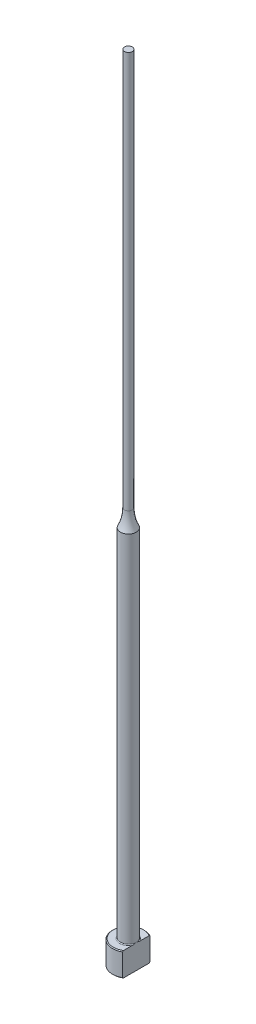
ISO-10303-21;
HEADER;
FILE_DESCRIPTION(('STEP AP214'),'2;1');
FILE_NAME('part.step','',(''),(''),'','','');
FILE_SCHEMA(('AUTOMOTIVE_DESIGN { 1 0 10303 214 1 1 1 1 }'));
ENDSEC;
DATA;
#1=APPLICATION_CONTEXT('core data for automotive mechanical design processes');
#2=APPLICATION_PROTOCOL_DEFINITION('international standard','automotive_design',2000,#1);
#3=PRODUCT_CONTEXT('',#1,'mechanical');
#4=PRODUCT('Part','Part','',(#3));
#5=PRODUCT_RELATED_PRODUCT_CATEGORY('part','',(#4));
#6=PRODUCT_DEFINITION_FORMATION('','',#4);
#7=PRODUCT_DEFINITION_CONTEXT('part definition',#1,'design');
#8=PRODUCT_DEFINITION('design','',#6,#7);
#9=PRODUCT_DEFINITION_SHAPE('','',#8);
#10=(LENGTH_UNIT() NAMED_UNIT(*) SI_UNIT(.MILLI.,.METRE.));
#11=(NAMED_UNIT(*) PLANE_ANGLE_UNIT() SI_UNIT($,.RADIAN.));
#12=(NAMED_UNIT(*) SI_UNIT($,.STERADIAN.) SOLID_ANGLE_UNIT());
#13=UNCERTAINTY_MEASURE_WITH_UNIT(LENGTH_MEASURE(1.E-05),#10,'distance_accuracy_value','');
#14=(GEOMETRIC_REPRESENTATION_CONTEXT(3) GLOBAL_UNCERTAINTY_ASSIGNED_CONTEXT((#13)) GLOBAL_UNIT_ASSIGNED_CONTEXT((#10,
#11,#12)) REPRESENTATION_CONTEXT('',''));
#15=CARTESIAN_POINT('',(0.,0.,0.));
#16=DIRECTION('',(0.,0.,1.));
#17=DIRECTION('',(1.,0.,0.));
#18=AXIS2_PLACEMENT_3D('',#15,#16,#17);
#19=CARTESIAN_POINT('',(-3.99999999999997,6.,0.));
#20=DIRECTION('',(0.,1.,0.));
#21=DIRECTION('',(0.,0.,1.));
#22=AXIS2_PLACEMENT_3D('',#19,#20,#21);
#23=PLANE('',#22);
#24=CARTESIAN_POINT('',(0.,6.,0.));
#25=DIRECTION('',(0.,1.,0.));
#26=DIRECTION('',(0.,0.,1.));
#27=AXIS2_PLACEMENT_3D('',#24,#25,#26);
#28=CIRCLE('',#27,3.80000000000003);
#29=CARTESIAN_POINT('',(1.99999999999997,6.,-3.23109888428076));
#30=VERTEX_POINT('',#29);
#31=CARTESIAN_POINT('',(1.99999999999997,6.,3.23109888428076));
#32=VERTEX_POINT('',#31);
#33=EDGE_CURVE('E187',#30,#32,#28,.T.);
#34=ORIENTED_EDGE('',*,*,#33,.T.);
#35=DIRECTION('',(0.,0.,-1.));
#36=VECTOR('',#35,1.);
#37=CARTESIAN_POINT('',(1.99999999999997,6.,0.));
#38=LINE('',#37,#36);
#39=CARTESIAN_POINT('',(1.99999999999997,5.99999999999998,0.916515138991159));
#40=VERTEX_POINT('',#39);
#41=EDGE_CURVE('E57',#32,#40,#38,.T.);
#42=ORIENTED_EDGE('',*,*,#41,.T.);
#43=CARTESIAN_POINT('',(0.,6.,0.));
#44=DIRECTION('',(0.,1.,0.));
#45=DIRECTION('',(0.,0.,1.));
#46=AXIS2_PLACEMENT_3D('',#43,#44,#45);
#47=CIRCLE('',#46,2.19999999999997);
#48=CARTESIAN_POINT('',(1.99999999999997,5.99999999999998,-0.916515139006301));
#49=VERTEX_POINT('',#48);
#50=EDGE_CURVE('E108',#40,#49,#47,.F.);
#51=ORIENTED_EDGE('',*,*,#50,.T.);
#52=EDGE_CURVE('E137',#49,#30,#38,.T.);
#53=ORIENTED_EDGE('',*,*,#52,.T.);
#54=EDGE_LOOP('',(#34,#42,#51,#53));
#55=FACE_BOUND('',#54,.T.);
#56=ADVANCED_FACE('F32',(#55),#23,.T.);
#57=CARTESIAN_POINT('',(0.,259.958771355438,0.));
#58=DIRECTION('',(0.,1.,0.));
#59=DIRECTION('',(0.,0.,1.));
#60=AXIS2_PLACEMENT_3D('',#57,#58,#59);
#61=CYLINDRICAL_SURFACE('',#60,3.99999999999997);
#62=CARTESIAN_POINT('',(0.,5.80000000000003,0.));
#63=DIRECTION('',(0.,1.,0.));
#64=DIRECTION('',(0.,0.,1.));
#65=AXIS2_PLACEMENT_3D('',#62,#63,#64);
#66=CIRCLE('',#65,3.99999999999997);
#67=CARTESIAN_POINT('',(1.99999999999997,5.80000000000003,3.46410161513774));
#68=VERTEX_POINT('',#67);
#69=CARTESIAN_POINT('',(1.99999999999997,5.80000000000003,-3.46410161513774));
#70=VERTEX_POINT('',#69);
#71=EDGE_CURVE('E105',#68,#70,#66,.F.);
#72=ORIENTED_EDGE('',*,*,#71,.T.);
#73=DIRECTION('',(0.,-1.,0.));
#74=VECTOR('',#73,1.);
#75=CARTESIAN_POINT('',(1.99999999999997,200.,-3.46410161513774));
#76=LINE('',#75,#74);
#77=CARTESIAN_POINT('',(1.99999999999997,0.199999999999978,-3.46410161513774));
#78=VERTEX_POINT('',#77);
#79=EDGE_CURVE('E193',#70,#78,#76,.T.);
#80=ORIENTED_EDGE('',*,*,#79,.T.);
#81=CARTESIAN_POINT('',(0.,0.199999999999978,0.));
#82=DIRECTION('',(0.,-1.,0.));
#83=DIRECTION('',(0.,0.,-1.));
#84=AXIS2_PLACEMENT_3D('',#81,#82,#83);
#85=CIRCLE('',#84,3.99999999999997);
#86=CARTESIAN_POINT('',(1.99999999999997,0.199999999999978,3.46410161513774));
#87=VERTEX_POINT('',#86);
#88=EDGE_CURVE('E100',#78,#87,#85,.F.);
#89=ORIENTED_EDGE('',*,*,#88,.T.);
#90=DIRECTION('',(0.,-1.,0.));
#91=VECTOR('',#90,1.);
#92=CARTESIAN_POINT('',(1.99999999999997,200.,3.46410161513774));
#93=LINE('',#92,#91);
#94=EDGE_CURVE('E93',#68,#87,#93,.T.);
#95=ORIENTED_EDGE('',*,*,#94,.F.);
#96=EDGE_LOOP('',(#72,#80,#89,#95));
#97=FACE_BOUND('',#96,.T.);
#98=ADVANCED_FACE('F158',(#97),#61,.T.);
#99=CARTESIAN_POINT('',(0.,0.,0.));
#100=DIRECTION('',(0.,-1.,0.));
#101=DIRECTION('',(0.,0.,-1.));
#102=AXIS2_PLACEMENT_3D('',#99,#100,#101);
#103=PLANE('',#102);
#104=CARTESIAN_POINT('',(0.,0.,0.));
#105=DIRECTION('',(0.,-1.,0.));
#106=DIRECTION('',(0.,0.,-1.));
#107=AXIS2_PLACEMENT_3D('',#104,#105,#106);
#108=CIRCLE('',#107,3.79999999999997);
#109=CARTESIAN_POINT('',(1.99999999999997,0.,3.23109888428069));
#110=VERTEX_POINT('',#109);
#111=CARTESIAN_POINT('',(1.99999999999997,0.,-3.23109888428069));
#112=VERTEX_POINT('',#111);
#113=EDGE_CURVE('E98',#110,#112,#108,.T.);
#114=ORIENTED_EDGE('',*,*,#113,.T.);
#115=DIRECTION('',(0.,0.,1.));
#116=VECTOR('',#115,1.);
#117=CARTESIAN_POINT('',(1.99999999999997,0.,3.46410161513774));
#118=LINE('',#117,#116);
#119=EDGE_CURVE('E83',#112,#110,#118,.T.);
#120=ORIENTED_EDGE('',*,*,#119,.T.);
#121=EDGE_LOOP('',(#114,#120));
#122=FACE_BOUND('',#121,.T.);
#123=ADVANCED_FACE('F103',(#122),#103,.T.);
#124=CARTESIAN_POINT('',(0.,6.00000000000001,0.));
#125=DIRECTION('',(0.,-1.,0.));
#126=DIRECTION('',(0.,0.,-1.));
#127=AXIS2_PLACEMENT_3D('',#124,#125,#126);
#128=CONICAL_SURFACE('',#127,3.80000000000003,0.785398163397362);
#129=ORIENTED_EDGE('',*,*,#71,.F.);
#130=CARTESIAN_POINT('',(1.99999999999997,1.91904532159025,7.62295524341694));
#131=CARTESIAN_POINT('',(1.99999999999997,2.08611243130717,7.4502239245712));
#132=CARTESIAN_POINT('',(1.99999999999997,2.25300024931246,7.27731861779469));
#133=CARTESIAN_POINT('',(1.99999999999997,2.58631125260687,6.93105655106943));
#134=CARTESIAN_POINT('',(1.99999999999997,2.75273443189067,6.75769978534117));
#135=CARTESIAN_POINT('',(1.99999999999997,3.08509080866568,6.41034692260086));
#136=CARTESIAN_POINT('',(1.99999999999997,3.25102371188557,6.23635054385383));
#137=CARTESIAN_POINT('',(1.99999999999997,3.58215598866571,5.88766284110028));
#138=CARTESIAN_POINT('',(1.99999999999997,3.74735536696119,5.71297152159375));
#139=CARTESIAN_POINT('',(1.99999999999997,4.0735385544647,5.36616839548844));
#140=CARTESIAN_POINT('',(1.99999999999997,4.23454099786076,5.19407412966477));
#141=CARTESIAN_POINT('',(1.99999999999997,4.55534102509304,4.84876663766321));
#142=CARTESIAN_POINT('',(1.99999999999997,4.71513861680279,4.67555341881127));
#143=CARTESIAN_POINT('',(1.99999999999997,5.0330618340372,4.32766569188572));
#144=CARTESIAN_POINT('',(1.99999999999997,5.191187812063,4.15299150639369));
#145=CARTESIAN_POINT('',(1.99999999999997,5.50513944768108,3.80159134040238));
#146=CARTESIAN_POINT('',(1.99999999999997,5.66096519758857,3.62486544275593));
#147=CARTESIAN_POINT('',(1.99999999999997,5.90974646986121,3.33722425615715));
#148=CARTESIAN_POINT('',(1.99999999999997,6.00376148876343,3.22722645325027));
#149=CARTESIAN_POINT('',(1.99999999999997,6.19011825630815,3.00579987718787));
#150=CARTESIAN_POINT('',(1.99999999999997,6.28245983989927,2.89437096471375));
#151=CARTESIAN_POINT('',(1.99999999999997,6.46586188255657,2.66849662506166));
#152=CARTESIAN_POINT('',(1.99999999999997,6.55689849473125,2.55403176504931));
#153=CARTESIAN_POINT('',(1.99999999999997,6.73578809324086,2.32266819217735));
#154=CARTESIAN_POINT('',(1.99999999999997,6.82364184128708,2.20577007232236));
#155=CARTESIAN_POINT('',(1.99999999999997,6.99612756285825,1.96688707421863));
#156=CARTESIAN_POINT('',(1.99999999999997,7.08069035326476,1.84485190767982));
#157=CARTESIAN_POINT('',(1.99999999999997,7.2430026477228,1.59599329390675));
#158=CARTESIAN_POINT('',(1.99999999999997,7.32074277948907,1.46916359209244));
#159=CARTESIAN_POINT('',(1.99999999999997,7.42869763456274,1.27510066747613));
#160=CARTESIAN_POINT('',(1.99999999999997,7.46305374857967,1.21018943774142));
#161=CARTESIAN_POINT('',(1.99999999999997,7.52837146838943,1.07868835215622));
#162=CARTESIAN_POINT('',(1.99999999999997,7.55933245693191,1.01209819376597));
#163=CARTESIAN_POINT('',(1.99999999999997,7.64566860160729,0.8098943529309));
#164=CARTESIAN_POINT('',(1.99999999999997,7.69478214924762,0.671360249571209));
#165=CARTESIAN_POINT('',(1.99999999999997,7.74794829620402,0.463657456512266));
#166=CARTESIAN_POINT('',(1.99999999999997,7.76205065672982,0.397033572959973));
#167=CARTESIAN_POINT('',(1.99999999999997,7.78390371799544,0.26272845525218));
#168=CARTESIAN_POINT('',(1.99999999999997,7.79165498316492,0.19504731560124));
#169=CARTESIAN_POINT('',(1.99999999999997,7.80025690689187,0.0594528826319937));
#170=CARTESIAN_POINT('',(1.99999999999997,7.80112894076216,-0.00845903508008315));
#171=CARTESIAN_POINT('',(1.99999999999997,7.79596585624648,-0.144020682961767));
#172=CARTESIAN_POINT('',(1.99999999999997,7.78993016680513,-0.211670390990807));
#173=CARTESIAN_POINT('',(1.99999999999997,7.77145363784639,-0.345483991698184));
#174=CARTESIAN_POINT('',(1.99999999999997,7.7590677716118,-0.411655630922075));
#175=CARTESIAN_POINT('',(1.99999999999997,7.72866360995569,-0.542678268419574));
#176=CARTESIAN_POINT('',(1.99999999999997,7.71064463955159,-0.607529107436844));
#177=CARTESIAN_POINT('',(1.99999999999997,7.669729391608,-0.736064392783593));
#178=CARTESIAN_POINT('',(1.99999999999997,7.64680564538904,-0.79973998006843));
#179=CARTESIAN_POINT('',(1.99999999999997,7.59700147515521,-0.925489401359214));
#180=CARTESIAN_POINT('',(1.99999999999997,7.57012185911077,-0.98756355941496));
#181=CARTESIAN_POINT('',(1.99999999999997,7.48443518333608,-1.17209020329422));
#182=CARTESIAN_POINT('',(1.99999999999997,7.42077407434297,-1.29228210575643));
#183=CARTESIAN_POINT('',(1.99999999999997,7.28502644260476,-1.52785770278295));
#184=CARTESIAN_POINT('',(1.99999999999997,7.21292931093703,-1.6432350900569));
#185=CARTESIAN_POINT('',(1.99999999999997,7.06281517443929,-1.8706938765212));
#186=CARTESIAN_POINT('',(1.99999999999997,6.98477595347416,-1.98276048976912));
#187=CARTESIAN_POINT('',(1.99999999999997,6.8248197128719,-2.20397837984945));
#188=CARTESIAN_POINT('',(1.99999999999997,6.74290465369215,-2.31313108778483));
#189=CARTESIAN_POINT('',(1.99999999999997,6.57517222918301,-2.5306854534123));
#190=CARTESIAN_POINT('',(1.99999999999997,6.4893176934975,-2.63905831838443));
#191=CARTESIAN_POINT('',(1.99999999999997,6.31548151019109,-2.85409686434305));
#192=CARTESIAN_POINT('',(1.99999999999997,6.22749963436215,-2.96076236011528));
#193=CARTESIAN_POINT('',(1.99999999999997,6.05015030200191,-3.17249211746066));
#194=CARTESIAN_POINT('',(1.99999999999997,5.96078672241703,-3.27755963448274));
#195=CARTESIAN_POINT('',(1.99999999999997,5.78082366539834,-3.48663191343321));
#196=CARTESIAN_POINT('',(1.99999999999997,5.69022416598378,-3.59063665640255));
#197=CARTESIAN_POINT('',(1.99999999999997,5.44796733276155,-3.86612439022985));
#198=CARTESIAN_POINT('',(1.99999999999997,5.29545972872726,-4.03685912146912));
#199=CARTESIAN_POINT('',(1.99999999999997,4.98858070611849,-4.37664803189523));
#200=CARTESIAN_POINT('',(1.99999999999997,4.83420923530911,-4.54570216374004));
#201=CARTESIAN_POINT('',(1.99999999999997,4.52396102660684,-4.88271638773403));
#202=CARTESIAN_POINT('',(1.99999999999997,4.36808300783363,-5.05067529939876));
#203=CARTESIAN_POINT('',(1.99999999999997,4.05530513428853,-5.38563883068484));
#204=CARTESIAN_POINT('',(1.99999999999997,3.8984052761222,-5.55264344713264));
#205=CARTESIAN_POINT('',(1.99999999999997,3.59029018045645,-5.87905385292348));
#206=CARTESIAN_POINT('',(1.99999999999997,3.43910664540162,-6.03848959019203));
#207=CARTESIAN_POINT('',(1.99999999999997,3.13616436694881,-6.35681456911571));
#208=CARTESIAN_POINT('',(1.99999999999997,2.98440562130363,-6.5157038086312));
#209=CARTESIAN_POINT('',(1.99999999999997,2.68059501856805,-6.83286192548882));
#210=CARTESIAN_POINT('',(1.99999999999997,2.52854367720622,-6.99113129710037));
#211=CARTESIAN_POINT('',(1.99999999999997,2.22406035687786,-7.30730102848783));
#212=CARTESIAN_POINT('',(1.99999999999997,2.07162838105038,-7.46520139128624));
#213=CARTESIAN_POINT('',(1.99999999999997,1.91904532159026,-7.62295524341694));
#214=B_SPLINE_CURVE_WITH_KNOTS('',3,(#130,#131,#132,#133,#134,#135,#136,#137,#138,#139,#140,
#141,#142,#143,#144,#145,#146,#147,#148,#149,#150,#151,#152,#153,#154,#155,#156,#157,#158,#159,
#160,#161,#162,#163,#164,#165,#166,#167,#168,#169,#170,#171,#172,#173,#174,#175,#176,#177,#178,
#179,#180,#181,#182,#183,#184,#185,#186,#187,#188,#189,#190,#191,#192,#193,#194,#195,#196,#197,
#198,#199,#200,#201,#202,#203,#204,#205,#206,#207,#208,#209,#210,#211,#212,#213),.UNSPECIFIED.,
.F.,.F.,(4,2,2,2,2,2,2,2,2,2,2,2,2,2,2,2,2,2,2,2,2,2,2,2,2,2,2,2,2,2,2,2,2,2,2,2,2,2,2,2,2,4),
(0.,0.720921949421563,1.4418531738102,2.16315326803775,2.8844486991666,3.59144103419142,
4.29842874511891,5.00526427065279,5.7120713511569,6.14616174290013,6.58029471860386,
7.01901494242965,7.45762947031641,7.90290456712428,8.34878206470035,8.56901415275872,
8.78928621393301,9.228144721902,9.43219512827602,9.63622739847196,9.83962544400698,
10.0430403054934,10.244723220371,10.4464303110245,10.6492980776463,10.8521244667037,
11.2595582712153,11.6675100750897,12.0770700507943,12.4864250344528,12.9011677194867,
13.3159550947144,13.7297367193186,14.1435257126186,14.8302935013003,15.5170805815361,
16.2045145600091,16.891950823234,17.5511045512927,18.2102608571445,18.8686819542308,
19.5270976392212),.UNSPECIFIED.);
#215=EDGE_CURVE('E136',#68,#32,#214,.T.);
#216=ORIENTED_EDGE('',*,*,#215,.T.);
#217=ORIENTED_EDGE('',*,*,#33,.F.);
#218=EDGE_CURVE('E128',#30,#70,#214,.T.);
#219=ORIENTED_EDGE('',*,*,#218,.T.);
#220=EDGE_LOOP('',(#129,#216,#217,#219));
#221=FACE_BOUND('',#220,.T.);
#222=ADVANCED_FACE('F144',(#221),#128,.T.);
#223=CARTESIAN_POINT('',(0.,0.199999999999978,0.));
#224=DIRECTION('',(0.,1.,0.));
#225=DIRECTION('',(0.,0.,1.));
#226=AXIS2_PLACEMENT_3D('',#223,#224,#225);
#227=CONICAL_SURFACE('',#226,3.99999999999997,0.7853981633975);
#228=ORIENTED_EDGE('',*,*,#88,.F.);
#229=CARTESIAN_POINT('',(1.99999999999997,4.08095467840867,-7.62295524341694));
#230=CARTESIAN_POINT('',(1.99999999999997,3.91388756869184,-7.45022392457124));
#231=CARTESIAN_POINT('',(1.99999999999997,3.74699975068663,-7.27731861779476));
#232=CARTESIAN_POINT('',(1.99999999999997,3.41368874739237,-6.93105655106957));
#233=CARTESIAN_POINT('',(1.99999999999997,3.24726556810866,-6.75769978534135));
#234=CARTESIAN_POINT('',(1.99999999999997,2.91490919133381,-6.4103469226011));
#235=CARTESIAN_POINT('',(1.99999999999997,2.74897628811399,-6.23635054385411));
#236=CARTESIAN_POINT('',(1.99999999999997,2.41784401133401,-5.88766284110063));
#237=CARTESIAN_POINT('',(1.99999999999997,2.25264463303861,-5.71297152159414));
#238=CARTESIAN_POINT('',(1.99999999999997,1.92646144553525,-5.3661683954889));
#239=CARTESIAN_POINT('',(1.99999999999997,1.76545900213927,-5.19407412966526));
#240=CARTESIAN_POINT('',(1.99999999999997,1.44465897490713,-4.84876663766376));
#241=CARTESIAN_POINT('',(1.99999999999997,1.28486138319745,-4.67555341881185));
#242=CARTESIAN_POINT('',(1.99999999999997,0.966938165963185,-4.32766569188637));
#243=CARTESIAN_POINT('',(1.99999999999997,0.80881218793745,-4.15299150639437));
#244=CARTESIAN_POINT('',(1.99999999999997,0.494860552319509,-3.80159134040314));
#245=CARTESIAN_POINT('',(1.99999999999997,0.339034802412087,-3.62486544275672));
#246=CARTESIAN_POINT('',(1.99999999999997,0.0902535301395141,-3.33722425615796));
#247=CARTESIAN_POINT('',(1.99999999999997,-0.0037614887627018,-3.22722645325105));
#248=CARTESIAN_POINT('',(1.99999999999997,-0.190118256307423,-3.0057998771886));
#249=CARTESIAN_POINT('',(1.99999999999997,-0.282459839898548,-2.89437096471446));
#250=CARTESIAN_POINT('',(1.99999999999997,-0.465861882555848,-2.66849662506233));
#251=CARTESIAN_POINT('',(1.99999999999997,-0.556898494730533,-2.55403176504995));
#252=CARTESIAN_POINT('',(1.99999999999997,-0.735788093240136,-2.32266819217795));
#253=CARTESIAN_POINT('',(1.99999999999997,-0.823641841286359,-2.20577007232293));
#254=CARTESIAN_POINT('',(1.99999999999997,-0.996127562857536,-1.96688707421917));
#255=CARTESIAN_POINT('',(1.99999999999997,-1.08069035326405,-1.84485190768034));
#256=CARTESIAN_POINT('',(1.99999999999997,-1.2430026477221,-1.59599329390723));
#257=CARTESIAN_POINT('',(1.99999999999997,-1.32074277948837,-1.4691635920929));
#258=CARTESIAN_POINT('',(1.99999999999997,-1.42869763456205,-1.27510066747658));
#259=CARTESIAN_POINT('',(1.99999999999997,-1.46305374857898,-1.21018943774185));
#260=CARTESIAN_POINT('',(1.99999999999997,-1.52837146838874,-1.07868835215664));
#261=CARTESIAN_POINT('',(1.99999999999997,-1.55933245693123,-1.01209819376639));
#262=CARTESIAN_POINT('',(1.99999999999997,-1.64566860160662,-0.809894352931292));
#263=CARTESIAN_POINT('',(1.99999999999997,-1.69478214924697,-0.671360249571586));
#264=CARTESIAN_POINT('',(1.99999999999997,-1.74794829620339,-0.463657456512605));
#265=CARTESIAN_POINT('',(1.99999999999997,-1.76205065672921,-0.397033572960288));
#266=CARTESIAN_POINT('',(1.99999999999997,-1.78390371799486,-0.262728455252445));
#267=CARTESIAN_POINT('',(1.99999999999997,-1.79165498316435,-0.19504731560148));
#268=CARTESIAN_POINT('',(1.99999999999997,-1.80025690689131,-0.059452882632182));
#269=CARTESIAN_POINT('',(1.99999999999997,-1.8011289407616,0.00845903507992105));
#270=CARTESIAN_POINT('',(1.99999999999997,-1.79596585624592,0.144020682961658));
#271=CARTESIAN_POINT('',(1.99999999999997,-1.78993016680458,0.211670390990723));
#272=CARTESIAN_POINT('',(1.99999999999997,-1.77145363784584,0.345483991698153));
#273=CARTESIAN_POINT('',(1.99999999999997,-1.75906777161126,0.411655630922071));
#274=CARTESIAN_POINT('',(1.99999999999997,-1.72866360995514,0.542678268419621));
#275=CARTESIAN_POINT('',(1.99999999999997,-1.71064463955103,0.607529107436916));
#276=CARTESIAN_POINT('',(1.99999999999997,-1.66972939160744,0.736064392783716));
#277=CARTESIAN_POINT('',(1.99999999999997,-1.64680564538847,0.799739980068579));
#278=CARTESIAN_POINT('',(1.99999999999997,-1.59700147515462,0.925489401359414));
#279=CARTESIAN_POINT('',(1.99999999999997,-1.57012185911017,0.987563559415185));
#280=CARTESIAN_POINT('',(1.99999999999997,-1.48443518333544,1.17209020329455));
#281=CARTESIAN_POINT('',(1.99999999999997,-1.4207740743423,1.29228210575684));
#282=CARTESIAN_POINT('',(1.99999999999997,-1.28502644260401,1.52785770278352));
#283=CARTESIAN_POINT('',(1.99999999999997,-1.21292931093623,1.64323509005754));
#284=CARTESIAN_POINT('',(1.99999999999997,-1.0628151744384,1.87069387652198));
#285=CARTESIAN_POINT('',(1.99999999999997,-0.984775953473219,1.98276048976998));
#286=CARTESIAN_POINT('',(1.99999999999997,-0.82481971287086,2.20397837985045));
#287=CARTESIAN_POINT('',(1.99999999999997,-0.742904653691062,2.31313108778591));
#288=CARTESIAN_POINT('',(1.99999999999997,-0.575172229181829,2.53068545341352));
#289=CARTESIAN_POINT('',(1.99999999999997,-0.489317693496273,2.63905831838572));
#290=CARTESIAN_POINT('',(1.99999999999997,-0.315481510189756,2.85409686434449));
#291=CARTESIAN_POINT('',(1.99999999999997,-0.227499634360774,2.9607623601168));
#292=CARTESIAN_POINT('',(1.99999999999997,-0.0501503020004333,3.17249211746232));
#293=CARTESIAN_POINT('',(1.99999999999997,0.0392132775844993,3.27755963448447));
#294=CARTESIAN_POINT('',(1.99999999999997,0.219176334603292,3.48663191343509));
#295=CARTESIAN_POINT('',(1.99999999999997,0.309775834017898,3.59063665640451));
#296=CARTESIAN_POINT('',(1.99999999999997,0.552032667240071,3.86612439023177));
#297=CARTESIAN_POINT('',(1.99999999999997,0.704540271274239,4.03685912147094));
#298=CARTESIAN_POINT('',(1.99999999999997,1.01141929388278,4.37664803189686));
#299=CARTESIAN_POINT('',(1.99999999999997,1.16579076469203,4.54570216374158));
#300=CARTESIAN_POINT('',(1.99999999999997,1.47603897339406,4.88271638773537));
#301=CARTESIAN_POINT('',(1.99999999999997,1.63191699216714,5.05067529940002));
#302=CARTESIAN_POINT('',(1.99999999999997,1.94469486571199,5.38563883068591));
#303=CARTESIAN_POINT('',(1.99999999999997,2.10159472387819,5.55264344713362));
#304=CARTESIAN_POINT('',(1.99999999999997,2.40970981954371,5.87905385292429));
#305=CARTESIAN_POINT('',(1.99999999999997,2.56089335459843,6.03848959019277));
#306=CARTESIAN_POINT('',(1.99999999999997,2.86383563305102,6.3568145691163));
#307=CARTESIAN_POINT('',(1.99999999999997,3.01559437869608,6.51570380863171));
#308=CARTESIAN_POINT('',(1.99999999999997,3.31940498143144,6.83286192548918));
#309=CARTESIAN_POINT('',(1.99999999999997,3.47145632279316,6.99113129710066));
#310=CARTESIAN_POINT('',(1.99999999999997,3.77593964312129,7.30730102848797));
#311=CARTESIAN_POINT('',(1.99999999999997,3.92837161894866,7.46520139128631));
#312=CARTESIAN_POINT('',(1.99999999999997,4.08095467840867,7.62295524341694));
#313=B_SPLINE_CURVE_WITH_KNOTS('',3,(#229,#230,#231,#232,#233,#234,#235,#236,#237,#238,#239,
#240,#241,#242,#243,#244,#245,#246,#247,#248,#249,#250,#251,#252,#253,#254,#255,#256,#257,#258,
#259,#260,#261,#262,#263,#264,#265,#266,#267,#268,#269,#270,#271,#272,#273,#274,#275,#276,#277,
#278,#279,#280,#281,#282,#283,#284,#285,#286,#287,#288,#289,#290,#291,#292,#293,#294,#295,#296,
#297,#298,#299,#300,#301,#302,#303,#304,#305,#306,#307,#308,#309,#310,#311,#312),.UNSPECIFIED.,
.F.,.F.,(4,2,2,2,2,2,2,2,2,2,2,2,2,2,2,2,2,2,2,2,2,2,2,2,2,2,2,2,2,2,2,2,2,2,2,2,2,2,2,2,2,4),
(0.,0.720921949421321,1.44185317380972,2.16315326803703,2.88444869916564,3.59144103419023,
4.29842874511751,5.00526427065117,5.71207135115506,6.14616174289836,6.58029471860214,
7.01901494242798,7.45762947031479,7.90290456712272,8.34878206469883,8.56901415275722,
8.78928621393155,9.22814472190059,9.43219512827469,9.63622739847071,9.8396254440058,
10.0430403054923,10.24472322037,10.4464303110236,10.6492980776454,10.8521244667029,
11.2595582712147,11.6675100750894,12.0770700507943,12.4864250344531,12.9011677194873,
13.3159550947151,13.7297367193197,14.1435257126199,14.8302935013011,15.5170805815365,
16.204514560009,16.8919508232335,17.5511045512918,18.2102608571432,18.8686819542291,
19.5270976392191),.UNSPECIFIED.);
#314=EDGE_CURVE('E86',#78,#112,#313,.T.);
#315=ORIENTED_EDGE('',*,*,#314,.T.);
#316=ORIENTED_EDGE('',*,*,#113,.F.);
#317=EDGE_CURVE('E89',#110,#87,#313,.T.);
#318=ORIENTED_EDGE('',*,*,#317,.T.);
#319=EDGE_LOOP('',(#228,#315,#316,#318));
#320=FACE_BOUND('',#319,.T.);
#321=ADVANCED_FACE('F97',(#320),#227,.T.);
#322=CARTESIAN_POINT('',(0.,6.19999999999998,0.));
#323=DIRECTION('',(0.,1.,0.));
#324=DIRECTION('',(0.,0.,1.));
#325=AXIS2_PLACEMENT_3D('',#322,#323,#324);
#326=TOROIDAL_SURFACE('',#325,2.19999999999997,0.2);
#327=CARTESIAN_POINT('',(1.99999999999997,6.19999999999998,0.));
#328=CARTESIAN_POINT('',(1.99999999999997,6.20000050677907,1.13930141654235E-10));
#329=CARTESIAN_POINT('',(1.99999999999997,6.20000101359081,-1.46766795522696E-07));
#330=CARTESIAN_POINT('',(1.99999999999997,6.20000197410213,-5.82067451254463E-07));
#331=CARTESIAN_POINT('',(1.99999999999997,6.20000242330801,-8.77873018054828E-07));
#332=CARTESIAN_POINT('',(1.99999999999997,6.2000033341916,-1.5842451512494E-06));
#333=CARTESIAN_POINT('',(1.99999999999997,6.20000378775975,-2.00534283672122E-06));
#334=CARTESIAN_POINT('',(1.99999999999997,6.20000462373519,-2.89558841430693E-06));
#335=CARTESIAN_POINT('',(1.99999999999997,6.20000500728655,-3.36372325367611E-06));
#336=CARTESIAN_POINT('',(1.99999999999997,6.20000636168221,-5.10887550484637E-06));
#337=CARTESIAN_POINT('',(1.99999999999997,6.20000725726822,-6.44597279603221E-06));
#338=CARTESIAN_POINT('',(1.99999999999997,6.20000879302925,-9.14926716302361E-06));
#339=CARTESIAN_POINT('',(1.99999999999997,6.20000944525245,-1.0508971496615E-05));
#340=CARTESIAN_POINT('',(1.99999999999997,6.20001204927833,-1.60555880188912E-05));
#341=CARTESIAN_POINT('',(1.99999999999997,6.20001390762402,-2.02908747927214E-05));
#342=CARTESIAN_POINT('',(1.99999999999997,6.20001676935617,-2.84438494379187E-05));
#343=CARTESIAN_POINT('',(1.99999999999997,6.20001785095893,-3.23343259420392E-05));
#344=CARTESIAN_POINT('',(1.99999999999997,6.20002551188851,-6.06027145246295E-05));
#345=CARTESIAN_POINT('',(1.99999999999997,6.20003111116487,-8.51991847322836E-05));
#346=CARTESIAN_POINT('',(1.99999999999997,6.20005559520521,-0.00018156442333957));
#347=CARTESIAN_POINT('',(1.99999999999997,6.20007914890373,-0.000252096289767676));
#348=CARTESIAN_POINT('',(1.99999999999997,6.20017002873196,-0.00052958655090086));
#349=CARTESIAN_POINT('',(1.99999999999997,6.20023415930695,-0.00073729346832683));
#350=CARTESIAN_POINT('',(1.99999999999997,6.20048926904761,-0.00155657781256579));
#351=CARTESIAN_POINT('',(1.99999999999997,6.20068414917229,-0.00216722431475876));
#352=CARTESIAN_POINT('',(1.99999999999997,6.20148805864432,-0.0046938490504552));
#353=CARTESIAN_POINT('',(1.99999999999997,6.20209226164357,-0.00661098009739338));
#354=CARTESIAN_POINT('',(1.99999999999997,6.20822779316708,-0.026069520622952));
#355=CARTESIAN_POINT('',(1.99999999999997,6.21378174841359,-0.0436057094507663));
#356=CARTESIAN_POINT('',(1.99999999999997,6.22462834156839,-0.0780127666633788));
#357=CARTESIAN_POINT('',(1.99999999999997,6.22992277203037,-0.0948831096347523));
#358=CARTESIAN_POINT('',(1.99999999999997,6.24110477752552,-0.130713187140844));
#359=CARTESIAN_POINT('',(1.99999999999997,6.24698536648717,-0.149675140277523));
#360=CARTESIAN_POINT('',(1.99999999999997,6.25869835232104,-0.187834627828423));
#361=CARTESIAN_POINT('',(1.99999999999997,6.26452957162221,-0.207032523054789));
#362=CARTESIAN_POINT('',(1.99999999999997,6.27861584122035,-0.254071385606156));
#363=CARTESIAN_POINT('',(1.99999999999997,6.28678835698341,-0.281937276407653));
#364=CARTESIAN_POINT('',(1.99999999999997,6.30249503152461,-0.33711523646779));
#365=CARTESIAN_POINT('',(1.99999999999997,6.31003989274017,-0.364424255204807));
#366=CARTESIAN_POINT('',(1.99999999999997,6.32554795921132,-0.422841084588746));
#367=CARTESIAN_POINT('',(1.99999999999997,6.33343288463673,-0.453970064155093));
#368=CARTESIAN_POINT('',(1.99999999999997,6.34833120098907,-0.516667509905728));
#369=CARTESIAN_POINT('',(1.99999999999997,6.3553379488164,-0.548237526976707));
#370=CARTESIAN_POINT('',(1.99999999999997,6.37554978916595,-0.647984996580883));
#371=CARTESIAN_POINT('',(1.99999999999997,6.38665117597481,-0.716635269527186));
#372=CARTESIAN_POINT('',(1.99999999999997,6.39785773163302,-0.8324457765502));
#373=CARTESIAN_POINT('',(1.99999999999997,6.40036304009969,-0.879345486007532));
#374=CARTESIAN_POINT('',(1.99999999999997,6.39976024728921,-0.949238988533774));
#375=CARTESIAN_POINT('',(1.99999999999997,6.39886048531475,-0.97224857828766));
#376=CARTESIAN_POINT('',(1.99999999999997,6.39534463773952,-1.01812773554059));
#377=CARTESIAN_POINT('',(1.99999999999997,6.39273014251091,-1.04099741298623));
#378=CARTESIAN_POINT('',(1.99999999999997,6.38623968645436,-1.08102660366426));
#379=CARTESIAN_POINT('',(1.99999999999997,6.38280841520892,-1.09825717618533));
#380=CARTESIAN_POINT('',(1.99999999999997,6.37442567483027,-1.13243508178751));
#381=CARTESIAN_POINT('',(1.99999999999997,6.36946777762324,-1.14938089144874));
#382=CARTESIAN_POINT('',(1.99999999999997,6.35764172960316,-1.18276398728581));
#383=CARTESIAN_POINT('',(1.99999999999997,6.35075810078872,-1.1991959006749));
#384=CARTESIAN_POINT('',(1.99999999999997,6.33462082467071,-1.23083581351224));
#385=CARTESIAN_POINT('',(1.99999999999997,6.32537783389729,-1.24604892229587));
#386=CARTESIAN_POINT('',(1.99999999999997,6.30929159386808,-1.26715296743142));
#387=CARTESIAN_POINT('',(1.99999999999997,6.303567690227,-1.27389441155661));
#388=CARTESIAN_POINT('',(1.99999999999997,6.29128925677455,-1.28659894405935));
#389=CARTESIAN_POINT('',(1.99999999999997,6.28473413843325,-1.29256147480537));
#390=CARTESIAN_POINT('',(1.99999999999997,6.27066594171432,-1.30346436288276));
#391=CARTESIAN_POINT('',(1.99999999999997,6.26314132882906,-1.30839014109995));
#392=CARTESIAN_POINT('',(1.99999999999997,6.24727957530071,-1.31668687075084));
#393=CARTESIAN_POINT('',(1.99999999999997,6.23894498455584,-1.32006252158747));
#394=CARTESIAN_POINT('',(1.99999999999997,6.22424089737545,-1.3241557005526));
#395=CARTESIAN_POINT('',(1.99999999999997,6.21800630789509,-1.32536112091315));
#396=CARTESIAN_POINT('',(1.99999999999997,6.20542266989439,-1.32669615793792));
#397=CARTESIAN_POINT('',(1.99999999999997,6.19907368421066,-1.32682634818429));
#398=CARTESIAN_POINT('',(1.99999999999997,6.18645152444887,-1.32599950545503));
#399=CARTESIAN_POINT('',(1.99999999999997,6.18017831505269,-1.32504300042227));
#400=CARTESIAN_POINT('',(1.99999999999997,6.16787181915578,-1.32212308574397));
#401=CARTESIAN_POINT('',(1.99999999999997,6.16183869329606,-1.32015901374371));
#402=CARTESIAN_POINT('',(1.99999999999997,6.14844260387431,-1.31466566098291));
#403=CARTESIAN_POINT('',(1.99999999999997,6.14119825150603,-1.3108482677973));
#404=CARTESIAN_POINT('',(1.99999999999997,6.12742328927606,-1.30209252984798));
#405=CARTESIAN_POINT('',(1.99999999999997,6.12089414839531,-1.29715193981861));
#406=CARTESIAN_POINT('',(1.99999999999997,6.10554761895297,-1.28382084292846));
#407=CARTESIAN_POINT('',(1.99999999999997,6.09717242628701,-1.27492468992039));
#408=CARTESIAN_POINT('',(1.99999999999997,6.08188323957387,-1.25597903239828));
#409=CARTESIAN_POINT('',(1.99999999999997,6.07497120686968,-1.24592800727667));
#410=CARTESIAN_POINT('',(1.99999999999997,6.05771073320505,-1.21734573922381));
#411=CARTESIAN_POINT('',(1.99999999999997,6.04862251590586,-1.19806017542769));
#412=CARTESIAN_POINT('',(1.99999999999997,6.03323781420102,-1.15830155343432));
#413=CARTESIAN_POINT('',(1.99999999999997,6.02696471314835,-1.13782009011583));
#414=CARTESIAN_POINT('',(1.99999999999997,6.01659159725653,-1.09607450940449));
#415=CARTESIAN_POINT('',(1.99999999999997,6.01251776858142,-1.07480405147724));
#416=CARTESIAN_POINT('',(1.99999999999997,6.0061890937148,-1.03196822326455));
#417=CARTESIAN_POINT('',(1.99999999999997,6.00393768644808,-1.0104023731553));
#418=CARTESIAN_POINT('',(1.99999999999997,5.99950887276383,-0.946948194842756));
#419=CARTESIAN_POINT('',(1.99999999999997,5.99937097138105,-0.904921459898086));
#420=CARTESIAN_POINT('',(1.99999999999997,6.00391139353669,-0.800067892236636));
#421=CARTESIAN_POINT('',(1.99999999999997,6.01103947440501,-0.737378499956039));
#422=CARTESIAN_POINT('',(1.99999999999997,6.0310998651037,-0.61144432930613));
#423=CARTESIAN_POINT('',(1.99999999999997,6.04417074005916,-0.54822386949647));
#424=CARTESIAN_POINT('',(1.99999999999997,6.06920011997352,-0.442888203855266));
#425=CARTESIAN_POINT('',(1.99999999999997,6.08016343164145,-0.400527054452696));
#426=CARTESIAN_POINT('',(1.99999999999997,6.10315303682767,-0.316588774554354));
#427=CARTESIAN_POINT('',(1.99999999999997,6.11516655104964,-0.275008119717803));
#428=CARTESIAN_POINT('',(1.99999999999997,6.13853403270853,-0.196672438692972));
#429=CARTESIAN_POINT('',(1.99999999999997,6.14981294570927,-0.159894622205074));
#430=CARTESIAN_POINT('',(1.99999999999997,6.17316886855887,-0.0849211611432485));
#431=CARTESIAN_POINT('',(1.99999999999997,6.18525959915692,-0.046729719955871));
#432=CARTESIAN_POINT('',(1.99999999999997,6.1979086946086,-0.00660765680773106));
#433=CARTESIAN_POINT('',(1.99999999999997,6.19851400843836,-0.00468723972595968));
#434=CARTESIAN_POINT('',(1.99999999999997,6.199318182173,-0.00215985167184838));
#435=CARTESIAN_POINT('',(1.99999999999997,6.19951225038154,-0.0015517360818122));
#436=CARTESIAN_POINT('',(1.99999999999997,6.19976637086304,-0.000735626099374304));
#437=CARTESIAN_POINT('',(1.99999999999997,6.19983030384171,-0.000528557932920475));
#438=CARTESIAN_POINT('',(1.99999999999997,6.19992094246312,-0.00025181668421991));
#439=CARTESIAN_POINT('',(1.99999999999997,6.1999444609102,-0.000181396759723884));
#440=CARTESIAN_POINT('',(1.99999999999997,6.19996891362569,-8.51622338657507E-05));
#441=CARTESIAN_POINT('',(1.99999999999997,6.19997450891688,-6.05824645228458E-05));
#442=CARTESIAN_POINT('',(1.99999999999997,6.19998216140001,-3.23308902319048E-05));
#443=CARTESIAN_POINT('',(1.99999999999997,6.19998324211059,-2.8441435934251E-05));
#444=CARTESIAN_POINT('',(1.99999999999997,6.19998610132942,-2.02904710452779E-05));
#445=CARTESIAN_POINT('',(1.99999999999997,6.19998795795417,-1.6056119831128E-05));
#446=CARTESIAN_POINT('',(1.99999999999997,6.19999055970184,-1.05104411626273E-05));
#447=CARTESIAN_POINT('',(1.99999999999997,6.19999121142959,-9.15081317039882E-06));
#448=CARTESIAN_POINT('',(1.99999999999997,6.19999274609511,-6.44758195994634E-06));
#449=CARTESIAN_POINT('',(1.99999999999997,6.19999364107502,-5.11046373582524E-06));
#450=CARTESIAN_POINT('',(1.99999999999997,6.1999949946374,-3.36517635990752E-06));
#451=CARTESIAN_POINT('',(1.99999999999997,6.19999537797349,-2.8969795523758E-06));
#452=CARTESIAN_POINT('',(1.99999999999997,6.19999621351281,-2.00657125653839E-06));
#453=CARTESIAN_POINT('',(1.99999999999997,6.19999666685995,-1.58537196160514E-06));
#454=CARTESIAN_POINT('',(1.99999999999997,6.19999757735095,-8.78757217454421E-07));
#455=CARTESIAN_POINT('',(1.99999999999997,6.19999802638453,-5.82817893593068E-07));
#456=CARTESIAN_POINT('',(1.99999999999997,6.19999898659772,-1.47186735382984E-07));
#457=CARTESIAN_POINT('',(1.99999999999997,6.19999949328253,-1.13916285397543E-10));
#458=CARTESIAN_POINT('',(1.99999999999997,6.19999999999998,0.));
#459=B_SPLINE_CURVE_WITH_KNOTS('',3,(#327,#328,#329,#330,#331,#332,#333,#334,#335,#336,#337,
#338,#339,#340,#341,#342,#343,#344,#345,#346,#347,#348,#349,#350,#351,#352,#353,#354,#355,#356,
#357,#358,#359,#360,#361,#362,#363,#364,#365,#366,#367,#368,#369,#370,#371,#372,#373,#374,#375,
#376,#377,#378,#379,#380,#381,#382,#383,#384,#385,#386,#387,#388,#389,#390,#391,#392,#393,#394,
#395,#396,#397,#398,#399,#400,#401,#402,#403,#404,#405,#406,#407,#408,#409,#410,#411,#412,#413,
#414,#415,#416,#417,#418,#419,#420,#421,#422,#423,#424,#425,#426,#427,#428,#429,#430,#431,#432,
#433,#434,#435,#436,#437,#438,#439,#440,#441,#442,#443,#444,#445,#446,#447,#448,#449,#450,#451,
#452,#453,#454,#455,#456,#457,#458),.UNSPECIFIED.,.T.,.F.,(4,2,2,2,2,2,2,2,2,2,2,2,2,2,2,2,2,2,
2,2,2,2,2,2,2,2,2,2,2,2,2,2,2,2,2,2,2,2,2,2,2,2,2,2,2,2,2,2,2,2,2,2,2,2,2,2,2,2,2,2,2,2,2,2,2,
4),(0.,1.5236988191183E-06,3.13175174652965E-06,4.9793386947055E-06,6.79332712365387E-06,
1.16005918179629E-05,1.61211188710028E-05,2.99630983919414E-05,4.20611839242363E-05,
0.000117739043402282,0.000340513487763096,0.000992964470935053,0.00291555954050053,
0.00894623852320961,0.0641278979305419,0.117173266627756,0.176731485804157,0.23692308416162,
0.324038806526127,0.409031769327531,0.505353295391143,0.602364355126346,0.810598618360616,
0.951214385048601,1.02024793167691,1.08921754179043,1.14187257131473,1.19475241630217,
1.24807013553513,1.30115116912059,1.32762610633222,1.35411989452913,1.38096446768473,
1.40772711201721,1.42669285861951,1.44564848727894,1.46459491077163,1.48355380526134,
1.50798338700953,1.53246223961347,1.56891061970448,1.60540755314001,1.6690093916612,
1.73313017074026,1.79799846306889,1.86298887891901,1.9887768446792,2.17764082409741,
2.37115413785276,2.50240556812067,2.63223743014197,2.74764208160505,2.86781494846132,
2.87385601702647,2.8757706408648,2.87642108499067,2.87664350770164,2.87671913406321,
2.87673122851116,2.87674506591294,2.87674958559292,2.87675439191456,2.87675620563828,
2.87675805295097,2.87675966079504,2.87676118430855),.UNSPECIFIED.);
#460=CARTESIAN_POINT('',(1.99999999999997,6.19999999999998,0.));
#461=VERTEX_POINT('',#460);
#462=EDGE_CURVE('E11',#49,#461,#459,.T.);
#463=ORIENTED_EDGE('',*,*,#462,.F.);
#464=ORIENTED_EDGE('',*,*,#50,.F.);
#465=CARTESIAN_POINT('',(1.99999999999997,6.19999999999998,0.));
#466=CARTESIAN_POINT('',(1.99999999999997,6.19999949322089,-1.13930155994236E-10));
#467=CARTESIAN_POINT('',(1.99999999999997,6.19999898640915,1.46766795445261E-07));
#468=CARTESIAN_POINT('',(1.99999999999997,6.19999802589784,5.8206745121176E-07));
#469=CARTESIAN_POINT('',(1.99999999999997,6.19999757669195,8.77873018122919E-07));
#470=CARTESIAN_POINT('',(1.99999999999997,6.19999666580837,1.58424515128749E-06));
#471=CARTESIAN_POINT('',(1.99999999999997,6.19999621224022,2.00534283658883E-06));
#472=CARTESIAN_POINT('',(1.99999999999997,6.19999537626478,2.8955884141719E-06));
#473=CARTESIAN_POINT('',(1.99999999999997,6.19999499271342,3.36372325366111E-06));
#474=CARTESIAN_POINT('',(1.99999999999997,6.19999363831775,5.10887550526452E-06));
#475=CARTESIAN_POINT('',(1.99999999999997,6.19999274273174,6.44597279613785E-06));
#476=CARTESIAN_POINT('',(1.99999999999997,6.19999120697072,9.14926716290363E-06));
#477=CARTESIAN_POINT('',(1.99999999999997,6.19999055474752,1.05089714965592E-05));
#478=CARTESIAN_POINT('',(1.99999999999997,6.19998795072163,1.60555880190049E-05));
#479=CARTESIAN_POINT('',(1.99999999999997,6.19998609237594,2.02908747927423E-05));
#480=CARTESIAN_POINT('',(1.99999999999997,6.1999832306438,2.84438494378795E-05));
#481=CARTESIAN_POINT('',(1.99999999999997,6.19998214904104,3.23343259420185E-05));
#482=CARTESIAN_POINT('',(1.99999999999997,6.19997448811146,6.06027145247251E-05));
#483=CARTESIAN_POINT('',(1.99999999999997,6.1999688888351,8.51991847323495E-05));
#484=CARTESIAN_POINT('',(1.99999999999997,6.19994440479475,0.000181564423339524));
#485=CARTESIAN_POINT('',(1.99999999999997,6.19992085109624,0.000252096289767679));
#486=CARTESIAN_POINT('',(1.99999999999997,6.199829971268,0.000529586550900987));
#487=CARTESIAN_POINT('',(1.99999999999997,6.19976584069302,0.000737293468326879));
#488=CARTESIAN_POINT('',(1.99999999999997,6.19951073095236,0.00155657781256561));
#489=CARTESIAN_POINT('',(1.99999999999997,6.19931585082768,0.00216722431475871));
#490=CARTESIAN_POINT('',(1.99999999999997,6.19851194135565,0.00469384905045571));
#491=CARTESIAN_POINT('',(1.99999999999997,6.1979077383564,0.00661098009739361));
#492=CARTESIAN_POINT('',(1.99999999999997,6.19177220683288,0.0260695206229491));
#493=CARTESIAN_POINT('',(1.99999999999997,6.18621825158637,0.0436057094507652));
#494=CARTESIAN_POINT('',(1.99999999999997,6.17537165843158,0.078012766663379));
#495=CARTESIAN_POINT('',(1.99999999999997,6.1700772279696,0.0948831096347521));
#496=CARTESIAN_POINT('',(1.99999999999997,6.15889522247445,0.130713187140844));
#497=CARTESIAN_POINT('',(1.99999999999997,6.1530146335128,0.149675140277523));
#498=CARTESIAN_POINT('',(1.99999999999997,6.14130164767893,0.187834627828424));
#499=CARTESIAN_POINT('',(1.99999999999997,6.13547042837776,0.207032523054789));
#500=CARTESIAN_POINT('',(1.99999999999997,6.12138415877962,0.254071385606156));
#501=CARTESIAN_POINT('',(1.99999999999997,6.11321164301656,0.281937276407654));
#502=CARTESIAN_POINT('',(1.99999999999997,6.09750496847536,0.337115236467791));
#503=CARTESIAN_POINT('',(1.99999999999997,6.0899601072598,0.364424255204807));
#504=CARTESIAN_POINT('',(1.99999999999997,6.07445204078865,0.422841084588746));
#505=CARTESIAN_POINT('',(1.99999999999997,6.06656711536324,0.453970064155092));
#506=CARTESIAN_POINT('',(1.99999999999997,6.0516687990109,0.516667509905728));
#507=CARTESIAN_POINT('',(1.99999999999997,6.04466205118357,0.548237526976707));
#508=CARTESIAN_POINT('',(1.99999999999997,6.02445021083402,0.647984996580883));
#509=CARTESIAN_POINT('',(1.99999999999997,6.01334882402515,0.716635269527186));
#510=CARTESIAN_POINT('',(1.99999999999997,6.00214226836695,0.8324457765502));
#511=CARTESIAN_POINT('',(1.99999999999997,5.99963695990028,0.879345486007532));
#512=CARTESIAN_POINT('',(1.99999999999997,6.00023975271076,0.949238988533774));
#513=CARTESIAN_POINT('',(1.99999999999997,6.00113951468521,0.972248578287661));
#514=CARTESIAN_POINT('',(1.99999999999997,6.00465536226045,1.01812773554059));
#515=CARTESIAN_POINT('',(1.99999999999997,6.00726985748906,1.04099741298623));
#516=CARTESIAN_POINT('',(1.99999999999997,6.01376031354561,1.08102660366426));
#517=CARTESIAN_POINT('',(1.99999999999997,6.01719158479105,1.09825717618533));
#518=CARTESIAN_POINT('',(1.99999999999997,6.02557432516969,1.13243508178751));
#519=CARTESIAN_POINT('',(1.99999999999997,6.03053222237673,1.14938089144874));
#520=CARTESIAN_POINT('',(1.99999999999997,6.04235827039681,1.18276398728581));
#521=CARTESIAN_POINT('',(1.99999999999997,6.04924189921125,1.1991959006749));
#522=CARTESIAN_POINT('',(1.99999999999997,6.06537917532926,1.23083581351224));
#523=CARTESIAN_POINT('',(1.99999999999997,6.07462216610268,1.24604892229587));
#524=CARTESIAN_POINT('',(1.99999999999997,6.09070840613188,1.26715296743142));
#525=CARTESIAN_POINT('',(1.99999999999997,6.09643230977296,1.27389441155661));
#526=CARTESIAN_POINT('',(1.99999999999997,6.10871074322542,1.28659894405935));
#527=CARTESIAN_POINT('',(1.99999999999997,6.11526586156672,1.29256147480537));
#528=CARTESIAN_POINT('',(1.99999999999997,6.12933405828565,1.30346436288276));
#529=CARTESIAN_POINT('',(1.99999999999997,6.1368586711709,1.30839014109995));
#530=CARTESIAN_POINT('',(1.99999999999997,6.15272042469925,1.31668687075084));
#531=CARTESIAN_POINT('',(1.99999999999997,6.16105501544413,1.32006252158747));
#532=CARTESIAN_POINT('',(1.99999999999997,6.17575910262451,1.3241557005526));
#533=CARTESIAN_POINT('',(1.99999999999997,6.18199369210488,1.32536112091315));
#534=CARTESIAN_POINT('',(1.99999999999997,6.19457733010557,1.32669615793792));
#535=CARTESIAN_POINT('',(1.99999999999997,6.20092631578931,1.32682634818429));
#536=CARTESIAN_POINT('',(1.99999999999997,6.21354847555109,1.32599950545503));
#537=CARTESIAN_POINT('',(1.99999999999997,6.21982168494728,1.32504300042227));
#538=CARTESIAN_POINT('',(1.99999999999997,6.23212818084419,1.32212308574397));
#539=CARTESIAN_POINT('',(1.99999999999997,6.23816130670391,1.32015901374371));
#540=CARTESIAN_POINT('',(1.99999999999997,6.25155739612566,1.31466566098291));
#541=CARTESIAN_POINT('',(1.99999999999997,6.25880174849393,1.3108482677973));
#542=CARTESIAN_POINT('',(1.99999999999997,6.2725767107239,1.30209252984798));
#543=CARTESIAN_POINT('',(1.99999999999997,6.27910585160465,1.29715193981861));
#544=CARTESIAN_POINT('',(1.99999999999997,6.29445238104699,1.28382084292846));
#545=CARTESIAN_POINT('',(1.99999999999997,6.30282757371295,1.27492468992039));
#546=CARTESIAN_POINT('',(1.99999999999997,6.3181167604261,1.25597903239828));
#547=CARTESIAN_POINT('',(1.99999999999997,6.32502879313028,1.24592800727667));
#548=CARTESIAN_POINT('',(1.99999999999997,6.34228926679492,1.21734573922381));
#549=CARTESIAN_POINT('',(1.99999999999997,6.35137748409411,1.19806017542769));
#550=CARTESIAN_POINT('',(1.99999999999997,6.36676218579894,1.15830155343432));
#551=CARTESIAN_POINT('',(1.99999999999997,6.37303528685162,1.13782009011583));
#552=CARTESIAN_POINT('',(1.99999999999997,6.38340840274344,1.09607450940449));
#553=CARTESIAN_POINT('',(1.99999999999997,6.38748223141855,1.07480405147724));
#554=CARTESIAN_POINT('',(1.99999999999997,6.39381090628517,1.03196822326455));
#555=CARTESIAN_POINT('',(1.99999999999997,6.39606231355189,1.0104023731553));
#556=CARTESIAN_POINT('',(1.99999999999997,6.40049112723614,0.946948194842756));
#557=CARTESIAN_POINT('',(1.99999999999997,6.40062902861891,0.904921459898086));
#558=CARTESIAN_POINT('',(1.99999999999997,6.39608860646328,0.800067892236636));
#559=CARTESIAN_POINT('',(1.99999999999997,6.38896052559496,0.73737849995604));
#560=CARTESIAN_POINT('',(1.99999999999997,6.36890013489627,0.611444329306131));
#561=CARTESIAN_POINT('',(1.99999999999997,6.35582925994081,0.548223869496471));
#562=CARTESIAN_POINT('',(1.99999999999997,6.33079988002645,0.442888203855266));
#563=CARTESIAN_POINT('',(1.99999999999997,6.31983656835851,0.400527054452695));
#564=CARTESIAN_POINT('',(1.99999999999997,6.29684696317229,0.316588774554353));
#565=CARTESIAN_POINT('',(1.99999999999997,6.28483344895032,0.275008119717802));
#566=CARTESIAN_POINT('',(1.99999999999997,6.26146596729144,0.196672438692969));
#567=CARTESIAN_POINT('',(1.99999999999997,6.2501870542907,0.15989462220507));
#568=CARTESIAN_POINT('',(1.99999999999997,6.22683113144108,0.0849211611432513));
#569=CARTESIAN_POINT('',(1.99999999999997,6.214740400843,0.0467297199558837));
#570=CARTESIAN_POINT('',(1.99999999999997,6.20209130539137,0.00660765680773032));
#571=CARTESIAN_POINT('',(1.99999999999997,6.20148599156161,0.00468723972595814));
#572=CARTESIAN_POINT('',(1.99999999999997,6.20068181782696,0.00215985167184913));
#573=CARTESIAN_POINT('',(1.99999999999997,6.20048774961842,0.00155173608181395));
#574=CARTESIAN_POINT('',(1.99999999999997,6.20023362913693,0.000735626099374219));
#575=CARTESIAN_POINT('',(1.99999999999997,6.20016969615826,0.000528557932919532));
#576=CARTESIAN_POINT('',(1.99999999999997,6.20007905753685,0.000251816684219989));
#577=CARTESIAN_POINT('',(1.99999999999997,6.20005553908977,0.000181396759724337));
#578=CARTESIAN_POINT('',(1.99999999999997,6.20003108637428,8.51622338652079E-05));
#579=CARTESIAN_POINT('',(1.99999999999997,6.20002549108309,6.05824645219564E-05));
#580=CARTESIAN_POINT('',(1.99999999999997,6.20001783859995,3.2330890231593E-05));
#581=CARTESIAN_POINT('',(1.99999999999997,6.20001675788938,2.84414359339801E-05));
#582=CARTESIAN_POINT('',(1.99999999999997,6.20001389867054,2.02904710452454E-05));
#583=CARTESIAN_POINT('',(1.99999999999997,6.20001204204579,1.6056119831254E-05));
#584=CARTESIAN_POINT('',(1.99999999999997,6.20000944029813,1.05104411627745E-05));
#585=CARTESIAN_POINT('',(1.99999999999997,6.20000878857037,9.15081317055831E-06));
#586=CARTESIAN_POINT('',(1.99999999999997,6.20000725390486,6.44758195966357E-06));
#587=CARTESIAN_POINT('',(1.99999999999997,6.20000635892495,5.11046373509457E-06));
#588=CARTESIAN_POINT('',(1.99999999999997,6.20000500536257,3.36517636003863E-06));
#589=CARTESIAN_POINT('',(1.99999999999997,6.20000462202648,2.89697955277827E-06));
#590=CARTESIAN_POINT('',(1.99999999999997,6.20000378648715,2.00657125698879E-06));
#591=CARTESIAN_POINT('',(1.99999999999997,6.20000333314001,1.58537196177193E-06));
#592=CARTESIAN_POINT('',(1.99999999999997,6.20000242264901,8.78757217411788E-07));
#593=CARTESIAN_POINT('',(1.99999999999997,6.20000197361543,5.82817893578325E-07));
#594=CARTESIAN_POINT('',(1.99999999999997,6.20000101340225,1.47186735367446E-07));
#595=CARTESIAN_POINT('',(1.99999999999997,6.20000050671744,1.13916299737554E-10));
#596=CARTESIAN_POINT('',(1.99999999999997,6.19999999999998,0.));
#597=B_SPLINE_CURVE_WITH_KNOTS('',3,(#465,#466,#467,#468,#469,#470,#471,#472,#473,#474,#475,
#476,#477,#478,#479,#480,#481,#482,#483,#484,#485,#486,#487,#488,#489,#490,#491,#492,#493,#494,
#495,#496,#497,#498,#499,#500,#501,#502,#503,#504,#505,#506,#507,#508,#509,#510,#511,#512,#513,
#514,#515,#516,#517,#518,#519,#520,#521,#522,#523,#524,#525,#526,#527,#528,#529,#530,#531,#532,
#533,#534,#535,#536,#537,#538,#539,#540,#541,#542,#543,#544,#545,#546,#547,#548,#549,#550,#551,
#552,#553,#554,#555,#556,#557,#558,#559,#560,#561,#562,#563,#564,#565,#566,#567,#568,#569,#570,
#571,#572,#573,#574,#575,#576,#577,#578,#579,#580,#581,#582,#583,#584,#585,#586,#587,#588,#589,
#590,#591,#592,#593,#594,#595,#596),.UNSPECIFIED.,.T.,.F.,(4,2,2,2,2,2,2,2,2,2,2,2,2,2,2,2,2,2,
2,2,2,2,2,2,2,2,2,2,2,2,2,2,2,2,2,2,2,2,2,2,2,2,2,2,2,2,2,2,2,2,2,2,2,2,2,2,2,2,2,2,2,2,2,2,2,
4),(0.,1.5236988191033E-06,3.13175174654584E-06,4.97933869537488E-06,6.79332712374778E-06,
1.16005918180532E-05,1.61211188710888E-05,2.99630983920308E-05,4.20611839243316E-05,
0.000117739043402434,0.000340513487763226,0.000992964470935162,0.00291555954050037,
0.00894623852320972,0.0641278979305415,0.117173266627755,0.176731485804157,0.236923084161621,
0.324038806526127,0.409031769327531,0.505353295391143,0.602364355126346,0.810598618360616,
0.951214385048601,1.02024793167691,1.08921754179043,1.14187257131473,1.19475241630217,
1.24807013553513,1.30115116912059,1.32762610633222,1.35411989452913,1.38096446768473,
1.40772711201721,1.42669285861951,1.44564848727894,1.46459491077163,1.48355380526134,
1.50798338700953,1.53246223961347,1.56891061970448,1.60540755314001,1.6690093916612,
1.73313017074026,1.79799846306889,1.86298887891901,1.9887768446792,2.17764082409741,
2.37115413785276,2.50240556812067,2.63223743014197,2.74764208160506,2.86781494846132,
2.87385601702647,2.8757706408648,2.87642108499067,2.87664350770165,2.87671913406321,
2.87673122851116,2.87674506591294,2.87674958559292,2.87675439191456,2.87675620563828,
2.87675805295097,2.87675966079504,2.87676118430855),.UNSPECIFIED.);
#598=EDGE_CURVE('E46',#461,#40,#597,.T.);
#599=ORIENTED_EDGE('',*,*,#598,.F.);
#600=CARTESIAN_POINT('',(0.,6.19999999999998,0.));
#601=DIRECTION('',(0.,1.,0.));
#602=DIRECTION('',(0.,0.,1.));
#603=AXIS2_PLACEMENT_3D('',#600,#601,#602);
#604=CIRCLE('',#603,1.99999999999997);
#605=EDGE_CURVE('E104',#461,#461,#604,.T.);
#606=ORIENTED_EDGE('',*,*,#605,.F.);
#607=EDGE_LOOP('',(#463,#464,#599,#606));
#608=FACE_BOUND('',#607,.T.);
#609=ADVANCED_FACE('F34',(#608),#326,.F.);
#610=CARTESIAN_POINT('',(-0.999999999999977,200.,0.));
#611=DIRECTION('',(0.,1.,0.));
#612=DIRECTION('',(0.,0.,1.));
#613=AXIS2_PLACEMENT_3D('',#610,#611,#612);
#614=PLANE('',#613);
#615=CARTESIAN_POINT('',(0.,200.,0.));
#616=DIRECTION('',(0.,1.,0.));
#617=DIRECTION('',(0.,0.,1.));
#618=AXIS2_PLACEMENT_3D('',#615,#616,#617);
#619=CIRCLE('',#618,0.999999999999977);
#620=CARTESIAN_POINT('',(0.,200.,0.999999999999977));
#621=VERTEX_POINT('',#620);
#622=EDGE_CURVE('E186',#621,#621,#619,.T.);
#623=ORIENTED_EDGE('',*,*,#622,.T.);
#624=EDGE_LOOP('',(#623));
#625=FACE_BOUND('',#624,.T.);
#626=ADVANCED_FACE('F149',(#625),#614,.T.);
#627=CARTESIAN_POINT('',(0.,259.958771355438,0.));
#628=DIRECTION('',(0.,1.,0.));
#629=DIRECTION('',(0.,0.,1.));
#630=AXIS2_PLACEMENT_3D('',#627,#628,#629);
#631=CYLINDRICAL_SURFACE('',#630,0.999999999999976);
#632=CARTESIAN_POINT('',(0.,100.,0.));
#633=DIRECTION('',(0.,1.,0.));
#634=DIRECTION('',(0.,0.,1.));
#635=AXIS2_PLACEMENT_3D('',#632,#633,#634);
#636=CIRCLE('',#635,0.999999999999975);
#637=CARTESIAN_POINT('',(0.,100.,0.999999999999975));
#638=VERTEX_POINT('',#637);
#639=EDGE_CURVE('E183',#638,#638,#636,.T.);
#640=ORIENTED_EDGE('',*,*,#639,.T.);
#641=EDGE_LOOP('',(#640));
#642=FACE_BOUND('',#641,.T.);
#643=ORIENTED_EDGE('',*,*,#622,.F.);
#644=EDGE_LOOP('',(#643));
#645=FACE_BOUND('',#644,.T.);
#646=ADVANCED_FACE('F172',(#642,#645),#631,.T.);
#647=CARTESIAN_POINT('',(0.,100.,0.));
#648=DIRECTION('',(0.,1.,0.));
#649=DIRECTION('',(0.,0.,1.));
#650=AXIS2_PLACEMENT_3D('',#647,#648,#649);
#651=TOROIDAL_SURFACE('',#650,11.,10.);
#652=CARTESIAN_POINT('',(0.,95.6411010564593,0.));
#653=DIRECTION('',(0.,1.,0.));
#654=DIRECTION('',(0.,0.,1.));
#655=AXIS2_PLACEMENT_3D('',#652,#653,#654);
#656=CIRCLE('',#655,1.99999999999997);
#657=CARTESIAN_POINT('',(0.,95.6411010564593,1.99999999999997));
#658=VERTEX_POINT('',#657);
#659=EDGE_CURVE('E101',#658,#658,#656,.T.);
#660=ORIENTED_EDGE('',*,*,#659,.T.);
#661=EDGE_LOOP('',(#660));
#662=FACE_BOUND('',#661,.T.);
#663=ORIENTED_EDGE('',*,*,#639,.F.);
#664=EDGE_LOOP('',(#663));
#665=FACE_BOUND('',#664,.T.);
#666=ADVANCED_FACE('F169',(#662,#665),#651,.F.);
#667=CARTESIAN_POINT('',(0.,259.958771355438,0.));
#668=DIRECTION('',(0.,1.,0.));
#669=DIRECTION('',(0.,0.,1.));
#670=AXIS2_PLACEMENT_3D('',#667,#668,#669);
#671=CYLINDRICAL_SURFACE('',#670,1.99999999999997);
#672=ORIENTED_EDGE('',*,*,#605,.T.);
#673=EDGE_LOOP('',(#672));
#674=FACE_BOUND('',#673,.T.);
#675=ORIENTED_EDGE('',*,*,#659,.F.);
#676=EDGE_LOOP('',(#675));
#677=FACE_BOUND('',#676,.T.);
#678=ADVANCED_FACE('F122',(#674,#677),#671,.T.);
#679=CARTESIAN_POINT('',(1.99999999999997,200.,3.46410161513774));
#680=DIRECTION('',(1.,0.,0.));
#681=DIRECTION('',(0.,0.,-1.));
#682=AXIS2_PLACEMENT_3D('',#679,#680,#681);
#683=PLANE('',#682);
#684=ORIENTED_EDGE('',*,*,#79,.F.);
#685=ORIENTED_EDGE('',*,*,#218,.F.);
#686=ORIENTED_EDGE('',*,*,#52,.F.);
#687=ORIENTED_EDGE('',*,*,#462,.T.);
#688=ORIENTED_EDGE('',*,*,#598,.T.);
#689=ORIENTED_EDGE('',*,*,#41,.F.);
#690=ORIENTED_EDGE('',*,*,#215,.F.);
#691=ORIENTED_EDGE('',*,*,#94,.T.);
#692=ORIENTED_EDGE('',*,*,#317,.F.);
#693=ORIENTED_EDGE('',*,*,#119,.F.);
#694=ORIENTED_EDGE('',*,*,#314,.F.);
#695=EDGE_LOOP('',(#684,#685,#686,#687,#688,#689,#690,#691,#692,#693,#694));
#696=FACE_BOUND('',#695,.T.);
#697=ADVANCED_FACE('F85',(#696),#683,.T.);
#698=CLOSED_SHELL('',(#56,#98,#123,#222,#321,#609,#626,#646,#666,#678,#697));
#699=MANIFOLD_SOLID_BREP('B2',#698);
#700=ADVANCED_BREP_SHAPE_REPRESENTATION('',(#18,#699),#14);
#701=SHAPE_DEFINITION_REPRESENTATION(#9,#700);
ENDSEC;
END-ISO-10303-21;
